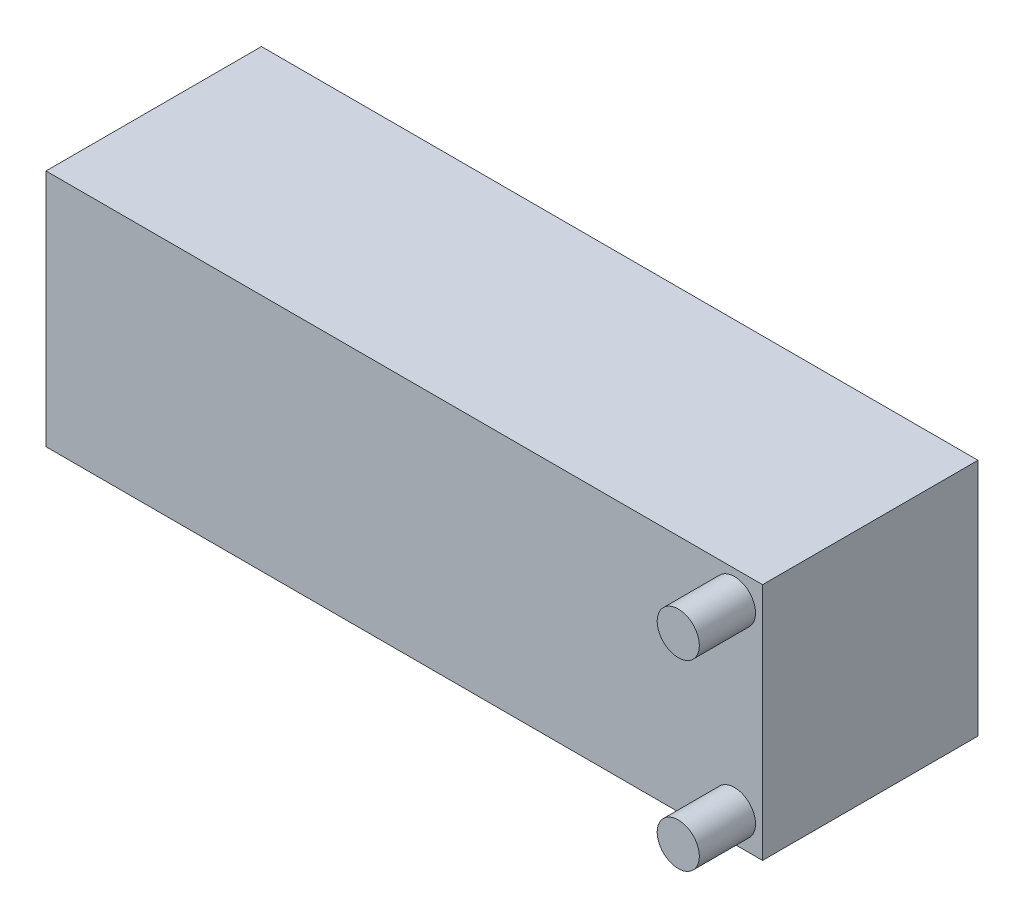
from build123d import *

# Parameters (mm, degrees)
SKETCH1_W           = 153
SKETCH1_H           = 46
BOSS_EXTRUDE1_DEPTH = 51
SKETCH2_R           = 4.5
BOSS_EXTRUDE2_DEPTH = 12


with BuildPart() as part:
    # Sketch1 → Boss-Extrude1 (new body)
    with BuildSketch(Plane(origin=(0, 0, 0), x_dir=(1, 0, 0), z_dir=(0, 1, 0))):
        with Locations((76.5, 23)):
            Rectangle(SKETCH1_W, SKETCH1_H)
    extrude(amount=BOSS_EXTRUDE1_DEPTH)

    # Sketch2 → Boss-Extrude2 (add)
    with BuildSketch(Plane.XY):
        with Locations(Location((147, 45, 0), (0, 0, 180))):
            Circle(SKETCH2_R)
        with Locations(Location((147, 6, 0), (0, 0, 180))):
            Circle(SKETCH2_R)
    extrude(amount=BOSS_EXTRUDE2_DEPTH)


solid = part.part
